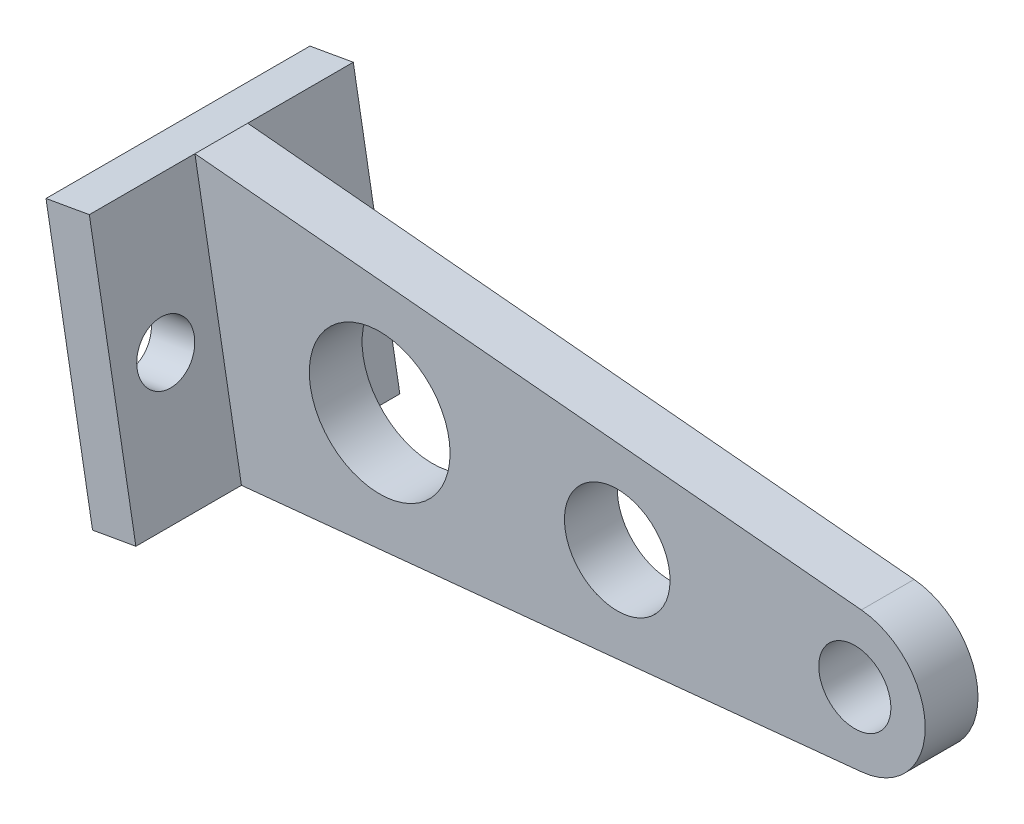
from build123d import *

# Parameters (mm, degrees)
ESQUISSE1_R             = 8
ESQUISSE1_R_2           = 6
ESQUISSE1_R_3           = 4.1
BASE_EXTRUSION_DEPTH    = 3
ESQUISSE2_W             = 30
ESQUISSE2_H             = 30.462798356
BOSS_EXTRU_1_DEPTH      = 5
ESQUISSE3_R             = 3.25
ENL_V_MAT_EXTRU_1_DEPTH = 5


with BuildPart() as part:
    # Esquisse1 → Base-Extrusion (new, symmetric)
    with BuildSketch(Plane.XY):
        with BuildLine():
            Line((54.739810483, 7.965719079), (-21, 15))
            Line((-21, 15), (-15.710190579, -15))
            Line((-15.710190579, -15), (54.79480908, -7.960419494))
            ThreePointArc((54.79480908, -7.960419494), (61.999952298, 0.027626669), (54.739810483, 7.965719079))
        make_face()
        Circle(ESQUISSE1_R, mode=Mode.SUBTRACT)
        with Locations((27, 0)):
            Circle(ESQUISSE1_R_2, mode=Mode.SUBTRACT)
        with Locations((54, 0)):
            Circle(ESQUISSE1_R_3, mode=Mode.SUBTRACT)
    extrude(amount=BASE_EXTRUSION_DEPTH, both=True)

    # Esquisse2 → Boss.-Extru.1 (add)
    with BuildSketch(Plane(origin=(-17.801621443, -3.138906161, 0), x_dir=(0, 0, 1), z_dir=(-0.9848077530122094, -0.17364817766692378, 0))):
        with Locations((0, 3.187328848)):
            Rectangle(ESQUISSE2_W, ESQUISSE2_H)
    extrude(amount=BOSS_EXTRU_1_DEPTH)

    # Esquisse3 → Enl_v. mat.-Extru.1 (cut)
    with BuildSketch(Plane(origin=(-22.725660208, -4.007147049, 0), x_dir=(0, 0, 1), z_dir=(-0.9848077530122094, -0.17364817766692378, 0))):
        with Locations(Location((9, 2.95592967, 0), (0, 0, 270))):
            Circle(ESQUISSE3_R)
        with Locations(Location((-9, 2.95592967, 0), (0, 0, 270))):
            Circle(ESQUISSE3_R)
    extrude(amount=-ENL_V_MAT_EXTRU_1_DEPTH, mode=Mode.SUBTRACT)


solid = part.part
